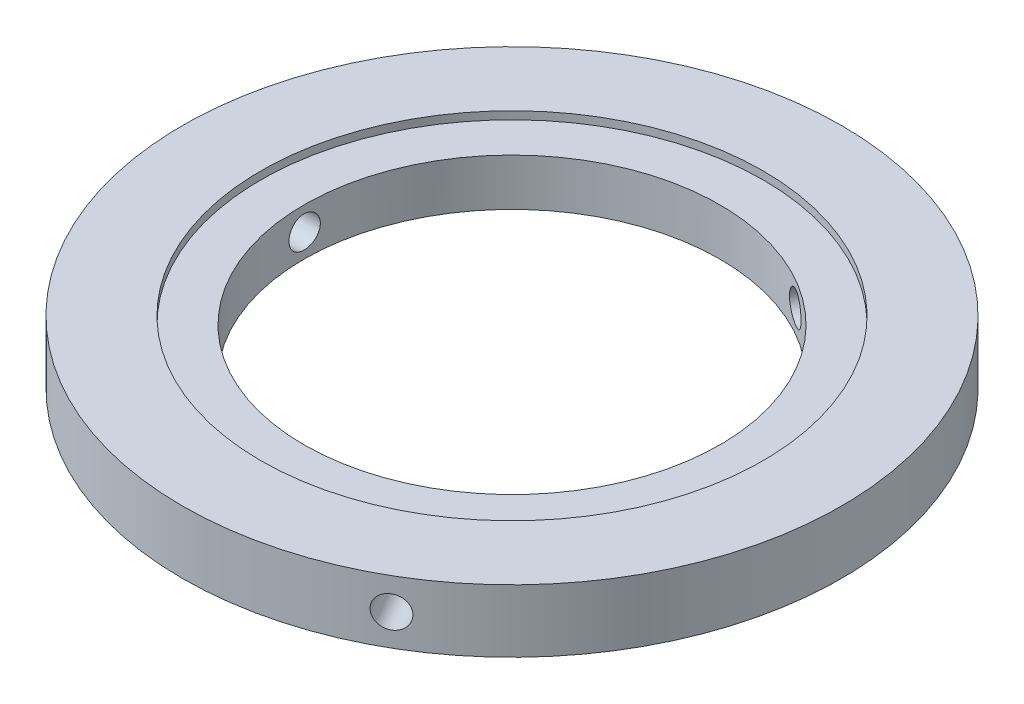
from build123d import *

# Parameters (mm, degrees)
SKETCH1_R               = 21
BOSS_EXTRUDE1_DEPTH     = 4
M30_TAPPED_HOLE1_D      = 26.5
CUT_EXTRUDE1_REACH      = 31.967
CUT_EXTRUDE1_END_RADIUS = 21
SKETCH4_R               = 1
CIRPATTERN1_COUNT       = 3
SKETCH5_R               = 16
CUT_EXTRUDE3_DEPTH      = 0.5
CUT_EXTRUDE4_START      = -0.5
SKETCH6_R               = 16
CUT_EXTRUDE4_DEPTH      = 0.5


with BuildPart() as part:
    # Sketch1 → Boss-Extrude1 (new body)
    with BuildSketch(Plane(origin=(0, 0, 0), x_dir=(1, 0, 0), z_dir=(0, 1, 0))):
        with Locations(Location((0, 0, 0), (0, 0, 270))):
            Circle(SKETCH1_R)
    extrude(amount=BOSS_EXTRUDE1_DEPTH)

    # M30 Tapped Hole1 (through all)
    with Locations(Plane(origin=(0, 4, 0), x_dir=(1, 0, 0), z_dir=(0, 1, 0))):
        with Locations((0, 0)):
            Hole(M30_TAPPED_HOLE1_D / 2)

    # Cut-Extrude1: up to this cylinder (the profile starts inside it)
    cut_extrude1_end = Plane(origin=(0, 2, 0), z_dir=(0, -1, 0)) * Cylinder(CUT_EXTRUDE1_END_RADIUS, 106.934, mode=Mode.PRIVATE)
    # Sketch4 → Cut-Extrude1 (cut, up to the surface)
    with BuildSketch(Plane(origin=(0, 0, 0), x_dir=(0, 0, -1), z_dir=(1, 0, 0)), mode=Mode.PRIVATE) as cut_extrude1_sk1:
        with Locations((0, 2)):
            Circle(SKETCH4_R)
    cut_extrude1_tool1 = extrude(cut_extrude1_sk1.sketch, amount=-CUT_EXTRUDE1_REACH, mode=Mode.PRIVATE) & cut_extrude1_end
    cut_extrude1 = cut_extrude1_tool1.solids().sort_by_distance((0, 2, 0))[0]
    add(cut_extrude1, mode=Mode.SUBTRACT)

    # CirPattern1: Cut-Extrude1 ×3 about axis
    cirpattern1_axis = Axis((0, 4, 0), (0, -1, 0))
    for i in range(1, CIRPATTERN1_COUNT):
        add(cut_extrude1.rotate(cirpattern1_axis, i * 360 / CIRPATTERN1_COUNT), mode=Mode.SUBTRACT)

    # Sketch5 → Cut-Extrude3 (cut)
    with BuildSketch(Plane(origin=(0, 4, 0), x_dir=(1, 0, 0), z_dir=(0, 1, 0))):
        with Locations(Location((0, 0, 0), (0, 0, 270))):
            Circle(SKETCH5_R)
    extrude(amount=-CUT_EXTRUDE3_DEPTH, mode=Mode.SUBTRACT)

    # Sketch6 → Cut-Extrude4 (cut)
    with BuildSketch(Plane.XZ.offset(CUT_EXTRUDE4_START)):
        with Locations(Location((0, 0, 0), (0, 0, 90))):
            Circle(SKETCH6_R)
    extrude(amount=CUT_EXTRUDE4_DEPTH, mode=Mode.SUBTRACT)


solid = part.part
